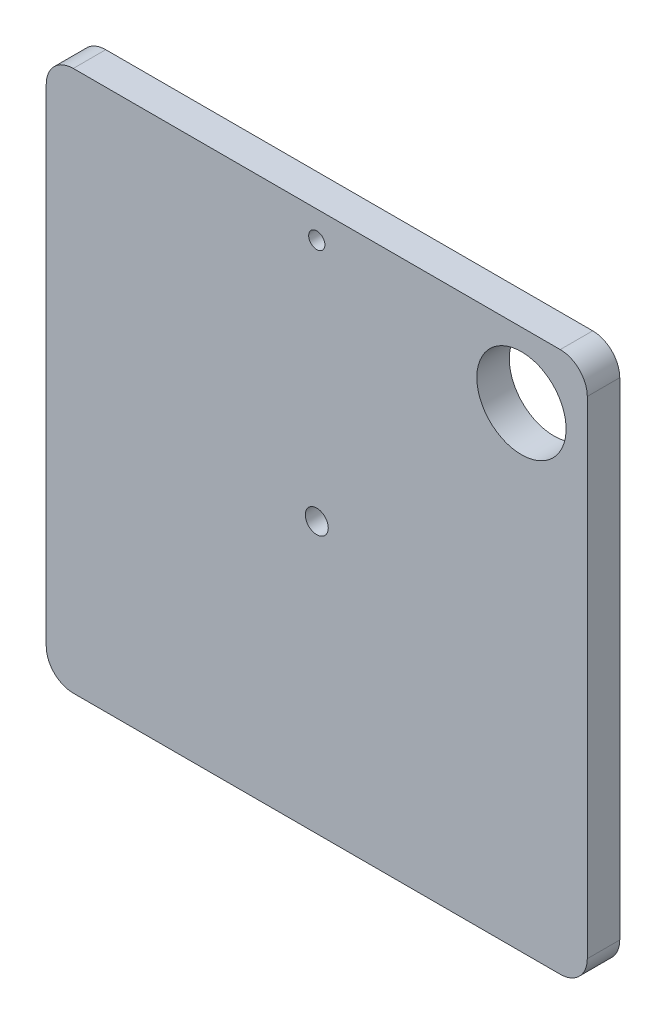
ISO-10303-21;
HEADER;
FILE_DESCRIPTION(('STEP AP214'),'2;1');
FILE_NAME('part.step','',(''),(''),'','','');
FILE_SCHEMA(('AUTOMOTIVE_DESIGN { 1 0 10303 214 1 1 1 1 }'));
ENDSEC;
DATA;
#1=APPLICATION_CONTEXT('core data for automotive mechanical design processes');
#2=APPLICATION_PROTOCOL_DEFINITION('international standard','automotive_design',2000,#1);
#3=PRODUCT_CONTEXT('',#1,'mechanical');
#4=PRODUCT('Part','Part','',(#3));
#5=PRODUCT_RELATED_PRODUCT_CATEGORY('part','',(#4));
#6=PRODUCT_DEFINITION_FORMATION('','',#4);
#7=PRODUCT_DEFINITION_CONTEXT('part definition',#1,'design');
#8=PRODUCT_DEFINITION('design','',#6,#7);
#9=PRODUCT_DEFINITION_SHAPE('','',#8);
#10=(LENGTH_UNIT() NAMED_UNIT(*) SI_UNIT(.MILLI.,.METRE.));
#11=(NAMED_UNIT(*) PLANE_ANGLE_UNIT() SI_UNIT($,.RADIAN.));
#12=(NAMED_UNIT(*) SI_UNIT($,.STERADIAN.) SOLID_ANGLE_UNIT());
#13=UNCERTAINTY_MEASURE_WITH_UNIT(LENGTH_MEASURE(1.E-05),#10,'distance_accuracy_value','');
#14=(GEOMETRIC_REPRESENTATION_CONTEXT(3) GLOBAL_UNCERTAINTY_ASSIGNED_CONTEXT((#13)) GLOBAL_UNIT_ASSIGNED_CONTEXT((#10,
#11,#12)) REPRESENTATION_CONTEXT('',''));
#15=CARTESIAN_POINT('',(0.,0.,0.));
#16=DIRECTION('',(0.,0.,1.));
#17=DIRECTION('',(1.,0.,0.));
#18=AXIS2_PLACEMENT_3D('',#15,#16,#17);
#19=CARTESIAN_POINT('',(0.,-200.,12.));
#20=DIRECTION('',(0.,0.,1.));
#21=DIRECTION('',(1.,0.,0.));
#22=AXIS2_PLACEMENT_3D('',#19,#20,#21);
#23=PLANE('',#22);
#24=CARTESIAN_POINT('',(175.660425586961,-24.3395744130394,12.));
#25=DIRECTION('',(0.,0.,-1.));
#26=DIRECTION('',(-1.,0.,0.));
#27=AXIS2_PLACEMENT_3D('',#24,#25,#26);
#28=CIRCLE('',#27,16.5);
#29=CARTESIAN_POINT('',(159.160425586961,-24.3395744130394,12.));
#30=VERTEX_POINT('',#29);
#31=EDGE_CURVE('E179',#30,#30,#28,.T.);
#32=ORIENTED_EDGE('',*,*,#31,.T.);
#33=EDGE_LOOP('',(#32));
#34=FACE_BOUND('',#33,.T.);
#35=CARTESIAN_POINT('',(100.,-10.,12.));
#36=DIRECTION('',(0.,0.,1.));
#37=DIRECTION('',(1.,0.,0.));
#38=AXIS2_PLACEMENT_3D('',#35,#36,#37);
#39=CIRCLE('',#38,3.00000000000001);
#40=CARTESIAN_POINT('',(103.,-10.,12.));
#41=VERTEX_POINT('',#40);
#42=EDGE_CURVE('E162',#41,#41,#39,.T.);
#43=ORIENTED_EDGE('',*,*,#42,.F.);
#44=EDGE_LOOP('',(#43));
#45=FACE_BOUND('',#44,.T.);
#46=DIRECTION('',(0.,1.,0.));
#47=VECTOR('',#46,1.);
#48=CARTESIAN_POINT('',(200.,0.,12.));
#49=LINE('',#48,#47);
#50=CARTESIAN_POINT('',(200.,-190.,12.));
#51=VERTEX_POINT('',#50);
#52=CARTESIAN_POINT('',(200.,-10.,12.));
#53=VERTEX_POINT('',#52);
#54=EDGE_CURVE('E169',#51,#53,#49,.T.);
#55=ORIENTED_EDGE('',*,*,#54,.T.);
#56=CARTESIAN_POINT('',(190.,-10.,12.));
#57=DIRECTION('',(0.,0.,1.));
#58=DIRECTION('',(1.,0.,0.));
#59=AXIS2_PLACEMENT_3D('',#56,#57,#58);
#60=CIRCLE('',#59,10.);
#61=CARTESIAN_POINT('',(190.,0.,12.));
#62=VERTEX_POINT('',#61);
#63=EDGE_CURVE('E146',#53,#62,#60,.T.);
#64=ORIENTED_EDGE('',*,*,#63,.T.);
#65=DIRECTION('',(-1.,0.,0.));
#66=VECTOR('',#65,1.);
#67=CARTESIAN_POINT('',(0.,0.,12.));
#68=LINE('',#67,#66);
#69=CARTESIAN_POINT('',(10.,0.,12.));
#70=VERTEX_POINT('',#69);
#71=EDGE_CURVE('E117',#62,#70,#68,.T.);
#72=ORIENTED_EDGE('',*,*,#71,.T.);
#73=CARTESIAN_POINT('',(10.,-10.,12.));
#74=DIRECTION('',(0.,0.,1.));
#75=DIRECTION('',(1.,0.,0.));
#76=AXIS2_PLACEMENT_3D('',#73,#74,#75);
#77=CIRCLE('',#76,10.);
#78=CARTESIAN_POINT('',(0.,-10.,12.));
#79=VERTEX_POINT('',#78);
#80=EDGE_CURVE('E144',#70,#79,#77,.T.);
#81=ORIENTED_EDGE('',*,*,#80,.T.);
#82=DIRECTION('',(0.,-1.,0.));
#83=VECTOR('',#82,1.);
#84=CARTESIAN_POINT('',(0.,0.,12.));
#85=LINE('',#84,#83);
#86=CARTESIAN_POINT('',(0.,-190.,12.));
#87=VERTEX_POINT('',#86);
#88=EDGE_CURVE('E124',#79,#87,#85,.T.);
#89=ORIENTED_EDGE('',*,*,#88,.T.);
#90=CARTESIAN_POINT('',(10.,-190.,12.));
#91=DIRECTION('',(0.,0.,1.));
#92=DIRECTION('',(1.,0.,0.));
#93=AXIS2_PLACEMENT_3D('',#90,#91,#92);
#94=CIRCLE('',#93,10.);
#95=CARTESIAN_POINT('',(10.,-200.,12.));
#96=VERTEX_POINT('',#95);
#97=EDGE_CURVE('E52',#87,#96,#94,.T.);
#98=ORIENTED_EDGE('',*,*,#97,.T.);
#99=DIRECTION('',(1.,0.,0.));
#100=VECTOR('',#99,1.);
#101=CARTESIAN_POINT('',(0.,-200.,12.));
#102=LINE('',#101,#100);
#103=CARTESIAN_POINT('',(190.,-200.,12.));
#104=VERTEX_POINT('',#103);
#105=EDGE_CURVE('E127',#96,#104,#102,.T.);
#106=ORIENTED_EDGE('',*,*,#105,.T.);
#107=CARTESIAN_POINT('',(190.,-190.,12.));
#108=DIRECTION('',(0.,0.,1.));
#109=DIRECTION('',(1.,0.,0.));
#110=AXIS2_PLACEMENT_3D('',#107,#108,#109);
#111=CIRCLE('',#110,10.);
#112=EDGE_CURVE('E141',#104,#51,#111,.T.);
#113=ORIENTED_EDGE('',*,*,#112,.T.);
#114=EDGE_LOOP('',(#55,#64,#72,#81,#89,#98,#106,#113));
#115=FACE_BOUND('',#114,.T.);
#116=CARTESIAN_POINT('',(100.,-100.,12.));
#117=DIRECTION('',(0.,0.,1.));
#118=DIRECTION('',(1.,0.,0.));
#119=AXIS2_PLACEMENT_3D('',#116,#117,#118);
#120=CIRCLE('',#119,4.25000000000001);
#121=CARTESIAN_POINT('',(104.25,-100.,12.));
#122=VERTEX_POINT('',#121);
#123=EDGE_CURVE('E174',#122,#122,#120,.T.);
#124=ORIENTED_EDGE('',*,*,#123,.F.);
#125=EDGE_LOOP('',(#124));
#126=FACE_BOUND('',#125,.T.);
#127=ADVANCED_FACE('F31',(#34,#45,#115,#126),#23,.T.);
#128=CARTESIAN_POINT('',(0.,-200.,0.));
#129=DIRECTION('',(0.,0.,1.));
#130=DIRECTION('',(1.,0.,0.));
#131=AXIS2_PLACEMENT_3D('',#128,#129,#130);
#132=PLANE('',#131);
#133=CARTESIAN_POINT('',(175.660425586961,-24.3395744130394,0.));
#134=DIRECTION('',(0.,0.,-1.));
#135=DIRECTION('',(-1.,0.,0.));
#136=AXIS2_PLACEMENT_3D('',#133,#134,#135);
#137=CIRCLE('',#136,16.5);
#138=CARTESIAN_POINT('',(159.160425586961,-24.3395744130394,0.));
#139=VERTEX_POINT('',#138);
#140=EDGE_CURVE('E182',#139,#139,#137,.T.);
#141=ORIENTED_EDGE('',*,*,#140,.F.);
#142=EDGE_LOOP('',(#141));
#143=FACE_BOUND('',#142,.T.);
#144=CARTESIAN_POINT('',(100.,-10.,0.));
#145=DIRECTION('',(0.,0.,1.));
#146=DIRECTION('',(1.,0.,0.));
#147=AXIS2_PLACEMENT_3D('',#144,#145,#146);
#148=CIRCLE('',#147,3.00000000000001);
#149=CARTESIAN_POINT('',(103.,-10.,0.));
#150=VERTEX_POINT('',#149);
#151=EDGE_CURVE('E165',#150,#150,#148,.T.);
#152=ORIENTED_EDGE('',*,*,#151,.T.);
#153=EDGE_LOOP('',(#152));
#154=FACE_BOUND('',#153,.T.);
#155=DIRECTION('',(-1.,0.,0.));
#156=VECTOR('',#155,1.);
#157=CARTESIAN_POINT('',(0.,0.,0.));
#158=LINE('',#157,#156);
#159=CARTESIAN_POINT('',(190.,0.,0.));
#160=VERTEX_POINT('',#159);
#161=CARTESIAN_POINT('',(10.,0.,0.));
#162=VERTEX_POINT('',#161);
#163=EDGE_CURVE('E114',#160,#162,#158,.T.);
#164=ORIENTED_EDGE('',*,*,#163,.F.);
#165=CARTESIAN_POINT('',(190.,-10.,0.));
#166=DIRECTION('',(0.,0.,1.));
#167=DIRECTION('',(1.,0.,0.));
#168=AXIS2_PLACEMENT_3D('',#165,#166,#167);
#169=CIRCLE('',#168,10.);
#170=CARTESIAN_POINT('',(200.,-10.,0.));
#171=VERTEX_POINT('',#170);
#172=EDGE_CURVE('E97',#160,#171,#169,.F.);
#173=ORIENTED_EDGE('',*,*,#172,.T.);
#174=DIRECTION('',(0.,1.,0.));
#175=VECTOR('',#174,1.);
#176=CARTESIAN_POINT('',(200.,0.,0.));
#177=LINE('',#176,#175);
#178=CARTESIAN_POINT('',(200.,-190.,0.));
#179=VERTEX_POINT('',#178);
#180=EDGE_CURVE('E125',#179,#171,#177,.T.);
#181=ORIENTED_EDGE('',*,*,#180,.F.);
#182=CARTESIAN_POINT('',(190.,-190.,0.));
#183=DIRECTION('',(0.,0.,1.));
#184=DIRECTION('',(1.,0.,0.));
#185=AXIS2_PLACEMENT_3D('',#182,#183,#184);
#186=CIRCLE('',#185,10.);
#187=CARTESIAN_POINT('',(190.,-200.,0.));
#188=VERTEX_POINT('',#187);
#189=EDGE_CURVE('E118',#179,#188,#186,.F.);
#190=ORIENTED_EDGE('',*,*,#189,.T.);
#191=DIRECTION('',(1.,0.,0.));
#192=VECTOR('',#191,1.);
#193=CARTESIAN_POINT('',(0.,-200.,0.));
#194=LINE('',#193,#192);
#195=CARTESIAN_POINT('',(10.,-200.,0.));
#196=VERTEX_POINT('',#195);
#197=EDGE_CURVE('E129',#196,#188,#194,.T.);
#198=ORIENTED_EDGE('',*,*,#197,.F.);
#199=CARTESIAN_POINT('',(10.,-190.,0.));
#200=DIRECTION('',(0.,0.,1.));
#201=DIRECTION('',(1.,0.,0.));
#202=AXIS2_PLACEMENT_3D('',#199,#200,#201);
#203=CIRCLE('',#202,10.);
#204=CARTESIAN_POINT('',(0.,-190.,0.));
#205=VERTEX_POINT('',#204);
#206=EDGE_CURVE('E135',#196,#205,#203,.F.);
#207=ORIENTED_EDGE('',*,*,#206,.T.);
#208=DIRECTION('',(0.,-1.,0.));
#209=VECTOR('',#208,1.);
#210=CARTESIAN_POINT('',(0.,0.,0.));
#211=LINE('',#210,#209);
#212=CARTESIAN_POINT('',(0.,-10.,0.));
#213=VERTEX_POINT('',#212);
#214=EDGE_CURVE('E157',#213,#205,#211,.T.);
#215=ORIENTED_EDGE('',*,*,#214,.F.);
#216=CARTESIAN_POINT('',(10.,-10.,0.));
#217=DIRECTION('',(0.,0.,1.));
#218=DIRECTION('',(1.,0.,0.));
#219=AXIS2_PLACEMENT_3D('',#216,#217,#218);
#220=CIRCLE('',#219,10.);
#221=EDGE_CURVE('E108',#213,#162,#220,.F.);
#222=ORIENTED_EDGE('',*,*,#221,.T.);
#223=EDGE_LOOP('',(#164,#173,#181,#190,#198,#207,#215,#222));
#224=FACE_BOUND('',#223,.T.);
#225=CARTESIAN_POINT('',(100.,-100.,0.));
#226=DIRECTION('',(0.,0.,1.));
#227=DIRECTION('',(1.,0.,0.));
#228=AXIS2_PLACEMENT_3D('',#225,#226,#227);
#229=CIRCLE('',#228,4.25000000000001);
#230=CARTESIAN_POINT('',(104.25,-100.,0.));
#231=VERTEX_POINT('',#230);
#232=EDGE_CURVE('E176',#231,#231,#229,.T.);
#233=ORIENTED_EDGE('',*,*,#232,.T.);
#234=EDGE_LOOP('',(#233));
#235=FACE_BOUND('',#234,.T.);
#236=ADVANCED_FACE('F121',(#143,#154,#224,#235),#132,.F.);
#237=CARTESIAN_POINT('',(0.,0.,12.));
#238=DIRECTION('',(1.,0.,0.));
#239=DIRECTION('',(0.,1.,0.));
#240=AXIS2_PLACEMENT_3D('',#237,#238,#239);
#241=PLANE('',#240);
#242=ORIENTED_EDGE('',*,*,#88,.F.);
#243=DIRECTION('',(0.,0.,-1.));
#244=VECTOR('',#243,1.);
#245=CARTESIAN_POINT('',(0.,-10.,12.));
#246=LINE('',#245,#244);
#247=EDGE_CURVE('E150',#79,#213,#246,.T.);
#248=ORIENTED_EDGE('',*,*,#247,.T.);
#249=ORIENTED_EDGE('',*,*,#214,.T.);
#250=DIRECTION('',(0.,0.,-1.));
#251=VECTOR('',#250,1.);
#252=CARTESIAN_POINT('',(0.,-190.,12.));
#253=LINE('',#252,#251);
#254=EDGE_CURVE('E148',#205,#87,#253,.F.);
#255=ORIENTED_EDGE('',*,*,#254,.T.);
#256=EDGE_LOOP('',(#242,#248,#249,#255));
#257=FACE_BOUND('',#256,.T.);
#258=ADVANCED_FACE('F156',(#257),#241,.F.);
#259=CARTESIAN_POINT('',(0.,-200.,12.));
#260=DIRECTION('',(0.,1.,0.));
#261=DIRECTION('',(0.,0.,1.));
#262=AXIS2_PLACEMENT_3D('',#259,#260,#261);
#263=PLANE('',#262);
#264=ORIENTED_EDGE('',*,*,#105,.F.);
#265=DIRECTION('',(0.,0.,-1.));
#266=VECTOR('',#265,1.);
#267=CARTESIAN_POINT('',(10.,-200.,12.));
#268=LINE('',#267,#266);
#269=EDGE_CURVE('E11',#96,#196,#268,.T.);
#270=ORIENTED_EDGE('',*,*,#269,.T.);
#271=ORIENTED_EDGE('',*,*,#197,.T.);
#272=DIRECTION('',(0.,0.,-1.));
#273=VECTOR('',#272,1.);
#274=CARTESIAN_POINT('',(190.,-200.,12.));
#275=LINE('',#274,#273);
#276=EDGE_CURVE('E39',#188,#104,#275,.F.);
#277=ORIENTED_EDGE('',*,*,#276,.T.);
#278=EDGE_LOOP('',(#264,#270,#271,#277));
#279=FACE_BOUND('',#278,.T.);
#280=ADVANCED_FACE('F221',(#279),#263,.F.);
#281=CARTESIAN_POINT('',(200.,0.,12.));
#282=DIRECTION('',(-1.,0.,0.));
#283=DIRECTION('',(0.,-1.,0.));
#284=AXIS2_PLACEMENT_3D('',#281,#282,#283);
#285=PLANE('',#284);
#286=ORIENTED_EDGE('',*,*,#180,.T.);
#287=DIRECTION('',(0.,0.,-1.));
#288=VECTOR('',#287,1.);
#289=CARTESIAN_POINT('',(200.,-10.,12.));
#290=LINE('',#289,#288);
#291=EDGE_CURVE('E102',#171,#53,#290,.F.);
#292=ORIENTED_EDGE('',*,*,#291,.T.);
#293=ORIENTED_EDGE('',*,*,#54,.F.);
#294=DIRECTION('',(0.,0.,-1.));
#295=VECTOR('',#294,1.);
#296=CARTESIAN_POINT('',(200.,-190.,12.));
#297=LINE('',#296,#295);
#298=EDGE_CURVE('E107',#51,#179,#297,.T.);
#299=ORIENTED_EDGE('',*,*,#298,.T.);
#300=EDGE_LOOP('',(#286,#292,#293,#299));
#301=FACE_BOUND('',#300,.T.);
#302=ADVANCED_FACE('F212',(#301),#285,.F.);
#303=CARTESIAN_POINT('',(0.,0.,12.));
#304=DIRECTION('',(0.,-1.,0.));
#305=DIRECTION('',(0.,0.,-1.));
#306=AXIS2_PLACEMENT_3D('',#303,#304,#305);
#307=PLANE('',#306);
#308=ORIENTED_EDGE('',*,*,#71,.F.);
#309=DIRECTION('',(0.,0.,-1.));
#310=VECTOR('',#309,1.);
#311=CARTESIAN_POINT('',(190.,0.,12.));
#312=LINE('',#311,#310);
#313=EDGE_CURVE('E101',#62,#160,#312,.T.);
#314=ORIENTED_EDGE('',*,*,#313,.T.);
#315=ORIENTED_EDGE('',*,*,#163,.T.);
#316=DIRECTION('',(0.,0.,-1.));
#317=VECTOR('',#316,1.);
#318=CARTESIAN_POINT('',(10.,0.,12.));
#319=LINE('',#318,#317);
#320=EDGE_CURVE('E119',#162,#70,#319,.F.);
#321=ORIENTED_EDGE('',*,*,#320,.T.);
#322=EDGE_LOOP('',(#308,#314,#315,#321));
#323=FACE_BOUND('',#322,.T.);
#324=ADVANCED_FACE('F113',(#323),#307,.F.);
#325=CARTESIAN_POINT('',(100.,-10.,12.));
#326=DIRECTION('',(0.,0.,-1.));
#327=DIRECTION('',(-1.,0.,0.));
#328=AXIS2_PLACEMENT_3D('',#325,#326,#327);
#329=CYLINDRICAL_SURFACE('',#328,3.00000000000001);
#330=ORIENTED_EDGE('',*,*,#42,.T.);
#331=EDGE_LOOP('',(#330));
#332=FACE_BOUND('',#331,.T.);
#333=ORIENTED_EDGE('',*,*,#151,.F.);
#334=EDGE_LOOP('',(#333));
#335=FACE_BOUND('',#334,.T.);
#336=ADVANCED_FACE('F202',(#332,#335),#329,.F.);
#337=CARTESIAN_POINT('',(100.,-100.,12.));
#338=DIRECTION('',(0.,0.,-1.));
#339=DIRECTION('',(-1.,0.,0.));
#340=AXIS2_PLACEMENT_3D('',#337,#338,#339);
#341=CYLINDRICAL_SURFACE('',#340,4.25000000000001);
#342=ORIENTED_EDGE('',*,*,#123,.T.);
#343=EDGE_LOOP('',(#342));
#344=FACE_BOUND('',#343,.T.);
#345=ORIENTED_EDGE('',*,*,#232,.F.);
#346=EDGE_LOOP('',(#345));
#347=FACE_BOUND('',#346,.T.);
#348=ADVANCED_FACE('F193',(#344,#347),#341,.F.);
#349=CARTESIAN_POINT('',(175.660425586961,-24.3395744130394,12.));
#350=DIRECTION('',(0.,0.,-1.));
#351=DIRECTION('',(-1.,0.,0.));
#352=AXIS2_PLACEMENT_3D('',#349,#350,#351);
#353=CYLINDRICAL_SURFACE('',#352,16.5);
#354=ORIENTED_EDGE('',*,*,#31,.F.);
#355=EDGE_LOOP('',(#354));
#356=FACE_BOUND('',#355,.T.);
#357=ORIENTED_EDGE('',*,*,#140,.T.);
#358=EDGE_LOOP('',(#357));
#359=FACE_BOUND('',#358,.T.);
#360=ADVANCED_FACE('F190',(#356,#359),#353,.F.);
#361=CARTESIAN_POINT('',(190.,-10.,12.));
#362=DIRECTION('',(0.,0.,-1.));
#363=DIRECTION('',(-1.,0.,0.));
#364=AXIS2_PLACEMENT_3D('',#361,#362,#363);
#365=CYLINDRICAL_SURFACE('',#364,10.);
#366=ORIENTED_EDGE('',*,*,#63,.F.);
#367=ORIENTED_EDGE('',*,*,#291,.F.);
#368=ORIENTED_EDGE('',*,*,#172,.F.);
#369=ORIENTED_EDGE('',*,*,#313,.F.);
#370=EDGE_LOOP('',(#366,#367,#368,#369));
#371=FACE_BOUND('',#370,.T.);
#372=ADVANCED_FACE('F100',(#371),#365,.T.);
#373=CARTESIAN_POINT('',(10.,-10.,12.));
#374=DIRECTION('',(0.,0.,-1.));
#375=DIRECTION('',(-1.,0.,0.));
#376=AXIS2_PLACEMENT_3D('',#373,#374,#375);
#377=CYLINDRICAL_SURFACE('',#376,10.);
#378=ORIENTED_EDGE('',*,*,#80,.F.);
#379=ORIENTED_EDGE('',*,*,#320,.F.);
#380=ORIENTED_EDGE('',*,*,#221,.F.);
#381=ORIENTED_EDGE('',*,*,#247,.F.);
#382=EDGE_LOOP('',(#378,#379,#380,#381));
#383=FACE_BOUND('',#382,.T.);
#384=ADVANCED_FACE('F229',(#383),#377,.T.);
#385=CARTESIAN_POINT('',(10.,-190.,12.));
#386=DIRECTION('',(0.,0.,-1.));
#387=DIRECTION('',(-1.,0.,0.));
#388=AXIS2_PLACEMENT_3D('',#385,#386,#387);
#389=CYLINDRICAL_SURFACE('',#388,10.);
#390=ORIENTED_EDGE('',*,*,#97,.F.);
#391=ORIENTED_EDGE('',*,*,#254,.F.);
#392=ORIENTED_EDGE('',*,*,#206,.F.);
#393=ORIENTED_EDGE('',*,*,#269,.F.);
#394=EDGE_LOOP('',(#390,#391,#392,#393));
#395=FACE_BOUND('',#394,.T.);
#396=ADVANCED_FACE('F231',(#395),#389,.T.);
#397=CARTESIAN_POINT('',(190.,-190.,12.));
#398=DIRECTION('',(0.,0.,-1.));
#399=DIRECTION('',(-1.,0.,0.));
#400=AXIS2_PLACEMENT_3D('',#397,#398,#399);
#401=CYLINDRICAL_SURFACE('',#400,10.);
#402=ORIENTED_EDGE('',*,*,#112,.F.);
#403=ORIENTED_EDGE('',*,*,#276,.F.);
#404=ORIENTED_EDGE('',*,*,#189,.F.);
#405=ORIENTED_EDGE('',*,*,#298,.F.);
#406=EDGE_LOOP('',(#402,#403,#404,#405));
#407=FACE_BOUND('',#406,.T.);
#408=ADVANCED_FACE('F33',(#407),#401,.T.);
#409=CLOSED_SHELL('',(#127,#236,#258,#280,#302,#324,#336,#348,#360,#372,#384,#396,#408));
#410=MANIFOLD_SOLID_BREP('B2',#409);
#411=ADVANCED_BREP_SHAPE_REPRESENTATION('',(#18,#410),#14);
#412=SHAPE_DEFINITION_REPRESENTATION(#9,#411);
ENDSEC;
END-ISO-10303-21;
